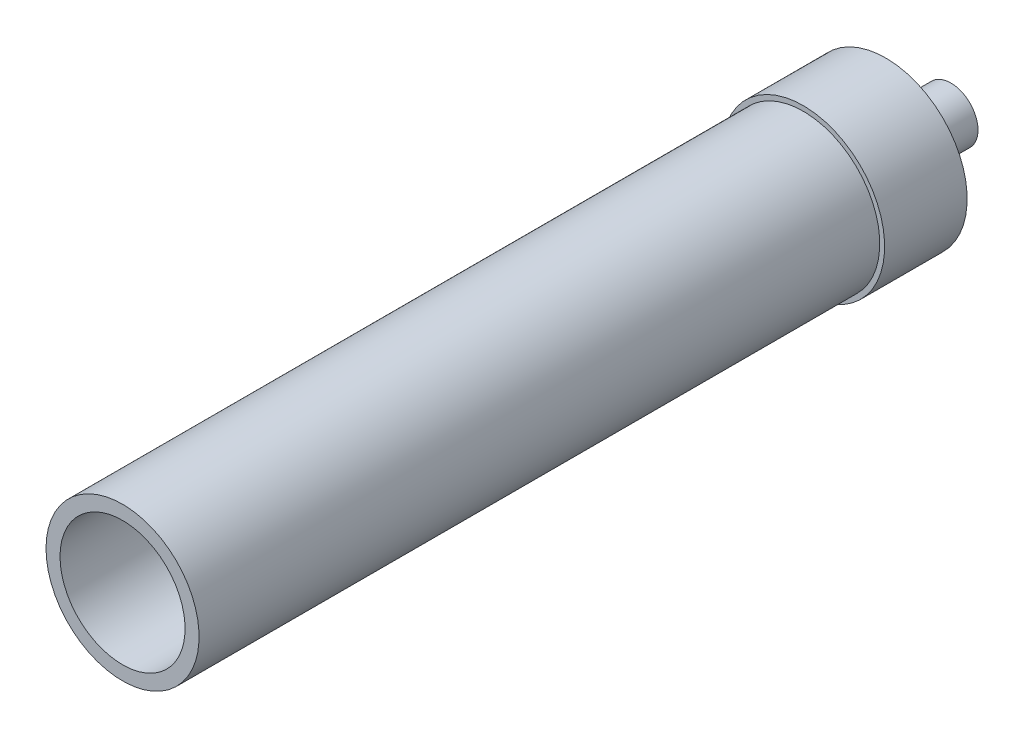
ISO-10303-21;
HEADER;
FILE_DESCRIPTION(('STEP AP214'),'2;1');
FILE_NAME('part.step','',(''),(''),'','','');
FILE_SCHEMA(('AUTOMOTIVE_DESIGN { 1 0 10303 214 1 1 1 1 }'));
ENDSEC;
DATA;
#1=APPLICATION_CONTEXT('core data for automotive mechanical design processes');
#2=APPLICATION_PROTOCOL_DEFINITION('international standard','automotive_design',2000,#1);
#3=PRODUCT_CONTEXT('',#1,'mechanical');
#4=PRODUCT('Part','Part','',(#3));
#5=PRODUCT_RELATED_PRODUCT_CATEGORY('part','',(#4));
#6=PRODUCT_DEFINITION_FORMATION('','',#4);
#7=PRODUCT_DEFINITION_CONTEXT('part definition',#1,'design');
#8=PRODUCT_DEFINITION('design','',#6,#7);
#9=PRODUCT_DEFINITION_SHAPE('','',#8);
#10=(LENGTH_UNIT() NAMED_UNIT(*) SI_UNIT(.MILLI.,.METRE.));
#11=(NAMED_UNIT(*) PLANE_ANGLE_UNIT() SI_UNIT($,.RADIAN.));
#12=(NAMED_UNIT(*) SI_UNIT($,.STERADIAN.) SOLID_ANGLE_UNIT());
#13=UNCERTAINTY_MEASURE_WITH_UNIT(LENGTH_MEASURE(1.E-05),#10,'distance_accuracy_value','');
#14=(GEOMETRIC_REPRESENTATION_CONTEXT(3) GLOBAL_UNCERTAINTY_ASSIGNED_CONTEXT((#13)) GLOBAL_UNIT_ASSIGNED_CONTEXT((#10,
#11,#12)) REPRESENTATION_CONTEXT('',''));
#15=CARTESIAN_POINT('',(0.,0.,0.));
#16=DIRECTION('',(0.,0.,1.));
#17=DIRECTION('',(1.,0.,0.));
#18=AXIS2_PLACEMENT_3D('',#15,#16,#17);
#19=CARTESIAN_POINT('',(0.,0.,0.));
#20=DIRECTION('',(0.,0.,1.));
#21=DIRECTION('',(1.,0.,0.));
#22=AXIS2_PLACEMENT_3D('',#19,#20,#21);
#23=PLANE('',#22);
#24=CARTESIAN_POINT('',(0.,0.,0.));
#25=DIRECTION('',(0.,0.,1.));
#26=DIRECTION('',(1.,0.,0.));
#27=AXIS2_PLACEMENT_3D('',#24,#25,#26);
#28=CIRCLE('',#27,9.525);
#29=CARTESIAN_POINT('',(-9.525,0.,0.));
#30=VERTEX_POINT('',#29);
#31=EDGE_CURVE('E56',#30,#30,#28,.T.);
#32=ORIENTED_EDGE('',*,*,#31,.F.);
#33=EDGE_LOOP('',(#32));
#34=FACE_BOUND('',#33,.T.);
#35=CARTESIAN_POINT('',(0.,0.,0.));
#36=DIRECTION('',(0.,0.,1.));
#37=DIRECTION('',(1.,0.,0.));
#38=AXIS2_PLACEMENT_3D('',#35,#36,#37);
#39=CIRCLE('',#38,4.445);
#40=CARTESIAN_POINT('',(4.445,0.,0.));
#41=VERTEX_POINT('',#40);
#42=EDGE_CURVE('E10',#41,#41,#39,.F.);
#43=ORIENTED_EDGE('',*,*,#42,.F.);
#44=EDGE_LOOP('',(#43));
#45=FACE_BOUND('',#44,.T.);
#46=ADVANCED_FACE('F30',(#34,#45),#23,.F.);
#47=CARTESIAN_POINT('',(0.,0.,89.281));
#48=DIRECTION('',(0.,0.,1.));
#49=DIRECTION('',(1.,0.,0.));
#50=AXIS2_PLACEMENT_3D('',#47,#48,#49);
#51=PLANE('',#50);
#52=CARTESIAN_POINT('',(0.,0.,89.281));
#53=DIRECTION('',(0.,0.,1.));
#54=DIRECTION('',(1.,0.,0.));
#55=AXIS2_PLACEMENT_3D('',#52,#53,#54);
#56=CIRCLE('',#55,8.9535);
#57=CARTESIAN_POINT('',(-8.95350000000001,0.,89.281));
#58=VERTEX_POINT('',#57);
#59=EDGE_CURVE('E41',#58,#58,#56,.T.);
#60=ORIENTED_EDGE('',*,*,#59,.T.);
#61=EDGE_LOOP('',(#60));
#62=FACE_BOUND('',#61,.T.);
#63=CARTESIAN_POINT('',(0.,0.,89.281));
#64=DIRECTION('',(0.,0.,1.));
#65=DIRECTION('',(1.,0.,0.));
#66=AXIS2_PLACEMENT_3D('',#63,#64,#65);
#67=CIRCLE('',#66,7.3152);
#68=CARTESIAN_POINT('',(-7.31520000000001,0.,89.281));
#69=VERTEX_POINT('',#68);
#70=EDGE_CURVE('E46',#69,#69,#67,.T.);
#71=ORIENTED_EDGE('',*,*,#70,.F.);
#72=EDGE_LOOP('',(#71));
#73=FACE_BOUND('',#72,.T.);
#74=ADVANCED_FACE('F75',(#62,#73),#51,.T.);
#75=CARTESIAN_POINT('',(0.,0.,89.281));
#76=DIRECTION('',(0.,0.,-1.));
#77=DIRECTION('',(-1.,0.,0.));
#78=AXIS2_PLACEMENT_3D('',#75,#76,#77);
#79=CYLINDRICAL_SURFACE('',#78,8.9535);
#80=CARTESIAN_POINT('',(0.,0.,9.65199999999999));
#81=DIRECTION('',(0.,0.,1.));
#82=DIRECTION('',(1.,0.,0.));
#83=AXIS2_PLACEMENT_3D('',#80,#81,#82);
#84=CIRCLE('',#83,8.9535);
#85=CARTESIAN_POINT('',(-8.9535,0.,9.65199999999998));
#86=VERTEX_POINT('',#85);
#87=EDGE_CURVE('E68',#86,#86,#84,.T.);
#88=CARTESIAN_POINT('',(-8.9535,0.,9.65199999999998));
#89=CARTESIAN_POINT('',(-8.9535,0.,10.48146875));
#90=CARTESIAN_POINT('',(-8.9535,0.,11.3109375));
#91=CARTESIAN_POINT('',(-8.9535,0.,12.969875));
#92=CARTESIAN_POINT('',(-8.9535,0.,13.79934375));
#93=CARTESIAN_POINT('',(-8.9535,0.,15.45828125));
#94=CARTESIAN_POINT('',(-8.9535,0.,16.28775));
#95=CARTESIAN_POINT('',(-8.9535,0.,17.9466875));
#96=CARTESIAN_POINT('',(-8.9535,0.,18.77615625));
#97=CARTESIAN_POINT('',(-8.9535,0.,20.43509375));
#98=CARTESIAN_POINT('',(-8.9535,0.,21.2645625));
#99=CARTESIAN_POINT('',(-8.9535,0.,22.9235));
#100=CARTESIAN_POINT('',(-8.9535,0.,23.75296875));
#101=CARTESIAN_POINT('',(-8.9535,0.,25.41190625));
#102=CARTESIAN_POINT('',(-8.9535,0.,26.241375));
#103=CARTESIAN_POINT('',(-8.9535,0.,27.9003125));
#104=CARTESIAN_POINT('',(-8.9535,0.,28.72978125));
#105=CARTESIAN_POINT('',(-8.9535,0.,30.38871875));
#106=CARTESIAN_POINT('',(-8.9535,0.,31.2181875));
#107=CARTESIAN_POINT('',(-8.9535,0.,32.877125));
#108=CARTESIAN_POINT('',(-8.9535,0.,33.70659375));
#109=CARTESIAN_POINT('',(-8.9535,0.,35.36553125));
#110=CARTESIAN_POINT('',(-8.9535,0.,36.195));
#111=CARTESIAN_POINT('',(-8.9535,0.,37.8539375));
#112=CARTESIAN_POINT('',(-8.95350000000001,0.,38.68340625));
#113=CARTESIAN_POINT('',(-8.95350000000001,0.,40.34234375));
#114=CARTESIAN_POINT('',(-8.95350000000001,0.,41.1718125));
#115=CARTESIAN_POINT('',(-8.95350000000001,0.,42.83075));
#116=CARTESIAN_POINT('',(-8.95350000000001,0.,43.66021875));
#117=CARTESIAN_POINT('',(-8.95350000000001,0.,45.31915625));
#118=CARTESIAN_POINT('',(-8.95350000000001,0.,46.148625));
#119=CARTESIAN_POINT('',(-8.95350000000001,0.,47.8075625));
#120=CARTESIAN_POINT('',(-8.95350000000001,0.,48.63703125));
#121=CARTESIAN_POINT('',(-8.95350000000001,0.,50.29596875));
#122=CARTESIAN_POINT('',(-8.95350000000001,0.,51.1254375));
#123=CARTESIAN_POINT('',(-8.95350000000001,0.,52.784375));
#124=CARTESIAN_POINT('',(-8.95350000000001,0.,53.61384375));
#125=CARTESIAN_POINT('',(-8.95350000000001,0.,55.27278125));
#126=CARTESIAN_POINT('',(-8.95350000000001,0.,56.10225));
#127=CARTESIAN_POINT('',(-8.95350000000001,0.,57.7611875));
#128=CARTESIAN_POINT('',(-8.95350000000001,0.,58.59065625));
#129=CARTESIAN_POINT('',(-8.95350000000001,0.,60.24959375));
#130=CARTESIAN_POINT('',(-8.95350000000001,0.,61.0790625));
#131=CARTESIAN_POINT('',(-8.95350000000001,0.,62.738));
#132=CARTESIAN_POINT('',(-8.95350000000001,0.,63.56746875));
#133=CARTESIAN_POINT('',(-8.95350000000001,0.,65.22640625));
#134=CARTESIAN_POINT('',(-8.95350000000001,0.,66.055875));
#135=CARTESIAN_POINT('',(-8.95350000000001,0.,67.7148125));
#136=CARTESIAN_POINT('',(-8.95350000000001,0.,68.54428125));
#137=CARTESIAN_POINT('',(-8.95350000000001,0.,70.20321875));
#138=CARTESIAN_POINT('',(-8.95350000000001,0.,71.0326875));
#139=CARTESIAN_POINT('',(-8.95350000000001,0.,72.691625));
#140=CARTESIAN_POINT('',(-8.95350000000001,0.,73.52109375));
#141=CARTESIAN_POINT('',(-8.95350000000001,0.,75.18003125));
#142=CARTESIAN_POINT('',(-8.95350000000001,0.,76.0094999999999));
#143=CARTESIAN_POINT('',(-8.95350000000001,0.,77.6684375));
#144=CARTESIAN_POINT('',(-8.95350000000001,0.,78.49790625));
#145=CARTESIAN_POINT('',(-8.95350000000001,0.,80.15684375));
#146=CARTESIAN_POINT('',(-8.95350000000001,0.,80.9863125));
#147=CARTESIAN_POINT('',(-8.95350000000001,0.,82.64525));
#148=CARTESIAN_POINT('',(-8.95350000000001,0.,83.47471875));
#149=CARTESIAN_POINT('',(-8.95350000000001,0.,85.13365625));
#150=CARTESIAN_POINT('',(-8.95350000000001,0.,85.963125));
#151=CARTESIAN_POINT('',(-8.95350000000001,0.,87.6220625));
#152=CARTESIAN_POINT('',(-8.95350000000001,0.,88.4515312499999));
#153=CARTESIAN_POINT('',(-8.95350000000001,0.,89.281));
#154=B_SPLINE_CURVE_WITH_KNOTS('',3,(#88,#89,#90,#91,#92,#93,#94,#95,#96,#97,#98,#99,#100,#101,
#102,#103,#104,#105,#106,#107,#108,#109,#110,#111,#112,#113,#114,#115,#116,#117,#118,#119,#120,
#121,#122,#123,#124,#125,#126,#127,#128,#129,#130,#131,#132,#133,#134,#135,#136,#137,#138,#139,
#140,#141,#142,#143,#144,#145,#146,#147,#148,#149,#150,#151,#152,#153),.UNSPECIFIED.,.F.,.F.,(4,
2,2,2,2,2,2,2,2,2,2,2,2,2,2,2,2,2,2,2,2,2,2,2,2,2,2,2,2,2,2,2,4),(0.,2.48840625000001,4.9768125,
7.46521875,9.95362499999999,12.44203125,14.9304375,17.41884375,19.90725,22.39565625,24.8840625,
27.37246875,29.860875,32.34928125,34.8376875,37.32609375,39.8145,42.30290625,44.7913125,
47.27971875,49.768125,52.25653125,54.7449375,57.23334375,59.72175,62.21015625,64.6985625,
67.18696875,69.675375,72.16378125,74.6521875,77.14059375,79.629),.UNSPECIFIED.);
#155=EDGE_CURVE('BSEAM32',#86,#58,#154,.T.);
#156=ORIENTED_EDGE('',*,*,#87,.T.);
#157=ORIENTED_EDGE('',*,*,#59,.F.);
#158=ORIENTED_EDGE('',*,*,#155,.T.);
#159=ORIENTED_EDGE('',*,*,#155,.F.);
#160=EDGE_LOOP('',(#156,#158,#157,#159));
#161=FACE_BOUND('',#160,.T.);
#162=ADVANCED_FACE('F32',(#161),#79,.T.);
#163=CARTESIAN_POINT('',(0.,0.,89.281));
#164=DIRECTION('',(0.,0.,-1.));
#165=DIRECTION('',(-1.,0.,0.));
#166=AXIS2_PLACEMENT_3D('',#163,#164,#165);
#167=CYLINDRICAL_SURFACE('',#166,7.3152);
#168=CARTESIAN_POINT('',(0.,0.,9.65199999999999));
#169=DIRECTION('',(0.,0.,1.));
#170=DIRECTION('',(1.,0.,0.));
#171=AXIS2_PLACEMENT_3D('',#168,#169,#170);
#172=CIRCLE('',#171,7.3152);
#173=CARTESIAN_POINT('',(-7.3152,0.,9.65199999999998));
#174=VERTEX_POINT('',#173);
#175=EDGE_CURVE('E37',#174,#174,#172,.T.);
#176=CARTESIAN_POINT('',(-7.3152,0.,9.65199999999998));
#177=CARTESIAN_POINT('',(-7.3152,0.,10.48146875));
#178=CARTESIAN_POINT('',(-7.3152,0.,11.3109375));
#179=CARTESIAN_POINT('',(-7.3152,0.,12.969875));
#180=CARTESIAN_POINT('',(-7.3152,0.,13.79934375));
#181=CARTESIAN_POINT('',(-7.3152,0.,15.45828125));
#182=CARTESIAN_POINT('',(-7.3152,0.,16.28775));
#183=CARTESIAN_POINT('',(-7.3152,0.,17.9466875));
#184=CARTESIAN_POINT('',(-7.3152,0.,18.77615625));
#185=CARTESIAN_POINT('',(-7.3152,0.,20.43509375));
#186=CARTESIAN_POINT('',(-7.3152,0.,21.2645625));
#187=CARTESIAN_POINT('',(-7.3152,0.,22.9235));
#188=CARTESIAN_POINT('',(-7.3152,0.,23.75296875));
#189=CARTESIAN_POINT('',(-7.3152,0.,25.41190625));
#190=CARTESIAN_POINT('',(-7.3152,0.,26.241375));
#191=CARTESIAN_POINT('',(-7.3152,0.,27.9003125));
#192=CARTESIAN_POINT('',(-7.3152,0.,28.72978125));
#193=CARTESIAN_POINT('',(-7.3152,0.,30.38871875));
#194=CARTESIAN_POINT('',(-7.3152,0.,31.2181875));
#195=CARTESIAN_POINT('',(-7.3152,0.,32.877125));
#196=CARTESIAN_POINT('',(-7.3152,0.,33.70659375));
#197=CARTESIAN_POINT('',(-7.3152,0.,35.36553125));
#198=CARTESIAN_POINT('',(-7.3152,0.,36.195));
#199=CARTESIAN_POINT('',(-7.3152,0.,37.8539375));
#200=CARTESIAN_POINT('',(-7.3152,0.,38.68340625));
#201=CARTESIAN_POINT('',(-7.3152,0.,40.34234375));
#202=CARTESIAN_POINT('',(-7.31520000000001,0.,41.1718125));
#203=CARTESIAN_POINT('',(-7.31520000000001,0.,42.83075));
#204=CARTESIAN_POINT('',(-7.31520000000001,0.,43.66021875));
#205=CARTESIAN_POINT('',(-7.31520000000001,0.,45.31915625));
#206=CARTESIAN_POINT('',(-7.31520000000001,0.,46.148625));
#207=CARTESIAN_POINT('',(-7.31520000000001,0.,47.8075625));
#208=CARTESIAN_POINT('',(-7.31520000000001,0.,48.63703125));
#209=CARTESIAN_POINT('',(-7.31520000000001,0.,50.29596875));
#210=CARTESIAN_POINT('',(-7.31520000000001,0.,51.1254375));
#211=CARTESIAN_POINT('',(-7.31520000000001,0.,52.784375));
#212=CARTESIAN_POINT('',(-7.31520000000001,0.,53.61384375));
#213=CARTESIAN_POINT('',(-7.31520000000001,0.,55.27278125));
#214=CARTESIAN_POINT('',(-7.31520000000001,0.,56.10225));
#215=CARTESIAN_POINT('',(-7.31520000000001,0.,57.7611875));
#216=CARTESIAN_POINT('',(-7.31520000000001,0.,58.59065625));
#217=CARTESIAN_POINT('',(-7.31520000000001,0.,60.24959375));
#218=CARTESIAN_POINT('',(-7.31520000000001,0.,61.0790625));
#219=CARTESIAN_POINT('',(-7.31520000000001,0.,62.738));
#220=CARTESIAN_POINT('',(-7.31520000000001,0.,63.56746875));
#221=CARTESIAN_POINT('',(-7.31520000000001,0.,65.22640625));
#222=CARTESIAN_POINT('',(-7.31520000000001,0.,66.055875));
#223=CARTESIAN_POINT('',(-7.31520000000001,0.,67.7148125));
#224=CARTESIAN_POINT('',(-7.31520000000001,0.,68.54428125));
#225=CARTESIAN_POINT('',(-7.31520000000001,0.,70.20321875));
#226=CARTESIAN_POINT('',(-7.31520000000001,0.,71.0326875));
#227=CARTESIAN_POINT('',(-7.31520000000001,0.,72.691625));
#228=CARTESIAN_POINT('',(-7.31520000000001,0.,73.52109375));
#229=CARTESIAN_POINT('',(-7.31520000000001,0.,75.18003125));
#230=CARTESIAN_POINT('',(-7.31520000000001,0.,76.0095));
#231=CARTESIAN_POINT('',(-7.31520000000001,0.,77.6684375));
#232=CARTESIAN_POINT('',(-7.31520000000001,0.,78.49790625));
#233=CARTESIAN_POINT('',(-7.31520000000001,0.,80.15684375));
#234=CARTESIAN_POINT('',(-7.31520000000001,0.,80.9863125));
#235=CARTESIAN_POINT('',(-7.31520000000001,0.,82.64525));
#236=CARTESIAN_POINT('',(-7.31520000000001,0.,83.47471875));
#237=CARTESIAN_POINT('',(-7.31520000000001,0.,85.13365625));
#238=CARTESIAN_POINT('',(-7.31520000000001,0.,85.963125));
#239=CARTESIAN_POINT('',(-7.31520000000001,0.,87.6220625));
#240=CARTESIAN_POINT('',(-7.31520000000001,0.,88.45153125));
#241=CARTESIAN_POINT('',(-7.31520000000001,0.,89.281));
#242=B_SPLINE_CURVE_WITH_KNOTS('',3,(#176,#177,#178,#179,#180,#181,#182,#183,#184,#185,#186,
#187,#188,#189,#190,#191,#192,#193,#194,#195,#196,#197,#198,#199,#200,#201,#202,#203,#204,#205,
#206,#207,#208,#209,#210,#211,#212,#213,#214,#215,#216,#217,#218,#219,#220,#221,#222,#223,#224,
#225,#226,#227,#228,#229,#230,#231,#232,#233,#234,#235,#236,#237,#238,#239,#240,#241),
.UNSPECIFIED.,.F.,.F.,(4,2,2,2,2,2,2,2,2,2,2,2,2,2,2,2,2,2,2,2,2,2,2,2,2,2,2,2,2,2,2,2,4),(0.,
2.48840625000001,4.9768125,7.46521875,9.95362499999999,12.44203125,14.9304375,17.41884375,
19.90725,22.39565625,24.8840625,27.37246875,29.860875,32.34928125,34.8376875,37.32609375,
39.8145,42.30290625,44.7913125,47.27971875,49.768125,52.25653125,54.7449375,57.23334375,
59.72175,62.21015625,64.6985625,67.18696875,69.675375,72.16378125,74.6521875,77.14059375,
79.629),.UNSPECIFIED.);
#243=EDGE_CURVE('BSEAM73',#174,#69,#242,.T.);
#244=ORIENTED_EDGE('',*,*,#175,.F.);
#245=ORIENTED_EDGE('',*,*,#70,.T.);
#246=ORIENTED_EDGE('',*,*,#243,.T.);
#247=ORIENTED_EDGE('',*,*,#243,.F.);
#248=EDGE_LOOP('',(#244,#246,#245,#247));
#249=FACE_BOUND('',#248,.T.);
#250=ADVANCED_FACE('F73',(#249),#167,.F.);
#251=CARTESIAN_POINT('',(0.,0.,9.65199999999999));
#252=DIRECTION('',(0.,0.,1.));
#253=DIRECTION('',(1.,0.,0.));
#254=AXIS2_PLACEMENT_3D('',#251,#252,#253);
#255=PLANE('',#254);
#256=ORIENTED_EDGE('',*,*,#175,.T.);
#257=EDGE_LOOP('',(#256));
#258=FACE_BOUND('',#257,.T.);
#259=ADVANCED_FACE('F88',(#258),#255,.T.);
#260=CARTESIAN_POINT('',(0.,0.,9.65199999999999));
#261=DIRECTION('',(0.,0.,1.));
#262=DIRECTION('',(1.,0.,0.));
#263=AXIS2_PLACEMENT_3D('',#260,#261,#262);
#264=CIRCLE('',#263,9.525);
#265=CARTESIAN_POINT('',(-9.525,0.,9.65199999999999));
#266=VERTEX_POINT('',#265);
#267=EDGE_CURVE('E65',#266,#266,#264,.T.);
#268=ORIENTED_EDGE('',*,*,#267,.T.);
#269=EDGE_LOOP('',(#268));
#270=FACE_BOUND('',#269,.T.);
#271=ORIENTED_EDGE('',*,*,#87,.F.);
#272=EDGE_LOOP('',(#271));
#273=FACE_BOUND('',#272,.T.);
#274=ADVANCED_FACE('F94',(#270,#273),#255,.T.);
#275=CARTESIAN_POINT('',(0.,0.,9.65199999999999));
#276=DIRECTION('',(0.,0.,-1.));
#277=DIRECTION('',(-1.,0.,0.));
#278=AXIS2_PLACEMENT_3D('',#275,#276,#277);
#279=CYLINDRICAL_SURFACE('',#278,9.525);
#280=CARTESIAN_POINT('',(-9.525,0.,9.65199999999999));
#281=CARTESIAN_POINT('',(-9.525,0.,9.55145833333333));
#282=CARTESIAN_POINT('',(-9.525,0.,9.45091666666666));
#283=CARTESIAN_POINT('',(-9.525,0.,9.24983333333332));
#284=CARTESIAN_POINT('',(-9.525,0.,9.14929166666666));
#285=CARTESIAN_POINT('',(-9.525,0.,8.94820833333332));
#286=CARTESIAN_POINT('',(-9.525,0.,8.84766666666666));
#287=CARTESIAN_POINT('',(-9.525,0.,8.64658333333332));
#288=CARTESIAN_POINT('',(-9.525,0.,8.54604166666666));
#289=CARTESIAN_POINT('',(-9.525,0.,8.34495833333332));
#290=CARTESIAN_POINT('',(-9.525,0.,8.24441666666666));
#291=CARTESIAN_POINT('',(-9.525,0.,8.04333333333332));
#292=CARTESIAN_POINT('',(-9.525,0.,7.94279166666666));
#293=CARTESIAN_POINT('',(-9.525,0.,7.74170833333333));
#294=CARTESIAN_POINT('',(-9.525,0.,7.64116666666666));
#295=CARTESIAN_POINT('',(-9.525,0.,7.44008333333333));
#296=CARTESIAN_POINT('',(-9.525,0.,7.33954166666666));
#297=CARTESIAN_POINT('',(-9.525,0.,7.13845833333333));
#298=CARTESIAN_POINT('',(-9.525,0.,7.03791666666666));
#299=CARTESIAN_POINT('',(-9.525,0.,6.83683333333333));
#300=CARTESIAN_POINT('',(-9.525,0.,6.73629166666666));
#301=CARTESIAN_POINT('',(-9.525,0.,6.53520833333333));
#302=CARTESIAN_POINT('',(-9.525,0.,6.43466666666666));
#303=CARTESIAN_POINT('',(-9.525,0.,6.23358333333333));
#304=CARTESIAN_POINT('',(-9.525,0.,6.13304166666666));
#305=CARTESIAN_POINT('',(-9.525,0.,5.93195833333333));
#306=CARTESIAN_POINT('',(-9.525,0.,5.83141666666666));
#307=CARTESIAN_POINT('',(-9.525,0.,5.63033333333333));
#308=CARTESIAN_POINT('',(-9.525,0.,5.52979166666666));
#309=CARTESIAN_POINT('',(-9.525,0.,5.32870833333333));
#310=CARTESIAN_POINT('',(-9.525,0.,5.22816666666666));
#311=CARTESIAN_POINT('',(-9.525,0.,5.02708333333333));
#312=CARTESIAN_POINT('',(-9.525,0.,4.92654166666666));
#313=CARTESIAN_POINT('',(-9.525,0.,4.72545833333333));
#314=CARTESIAN_POINT('',(-9.525,0.,4.62491666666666));
#315=CARTESIAN_POINT('',(-9.525,0.,4.42383333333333));
#316=CARTESIAN_POINT('',(-9.525,0.,4.32329166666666));
#317=CARTESIAN_POINT('',(-9.525,0.,4.12220833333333));
#318=CARTESIAN_POINT('',(-9.525,0.,4.02166666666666));
#319=CARTESIAN_POINT('',(-9.525,0.,3.82058333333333));
#320=CARTESIAN_POINT('',(-9.525,0.,3.72004166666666));
#321=CARTESIAN_POINT('',(-9.525,0.,3.51895833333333));
#322=CARTESIAN_POINT('',(-9.525,0.,3.41841666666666));
#323=CARTESIAN_POINT('',(-9.525,0.,3.21733333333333));
#324=CARTESIAN_POINT('',(-9.525,0.,3.11679166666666));
#325=CARTESIAN_POINT('',(-9.525,0.,2.91570833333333));
#326=CARTESIAN_POINT('',(-9.525,0.,2.81516666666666));
#327=CARTESIAN_POINT('',(-9.525,0.,2.61408333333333));
#328=CARTESIAN_POINT('',(-9.525,0.,2.51354166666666));
#329=CARTESIAN_POINT('',(-9.525,0.,2.31245833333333));
#330=CARTESIAN_POINT('',(-9.525,0.,2.21191666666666));
#331=CARTESIAN_POINT('',(-9.525,0.,2.01083333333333));
#332=CARTESIAN_POINT('',(-9.525,0.,1.91029166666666));
#333=CARTESIAN_POINT('',(-9.525,0.,1.70920833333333));
#334=CARTESIAN_POINT('',(-9.525,0.,1.60866666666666));
#335=CARTESIAN_POINT('',(-9.525,0.,1.40758333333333));
#336=CARTESIAN_POINT('',(-9.525,0.,1.30704166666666));
#337=CARTESIAN_POINT('',(-9.525,0.,1.10595833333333));
#338=CARTESIAN_POINT('',(-9.525,0.,1.00541666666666));
#339=CARTESIAN_POINT('',(-9.525,0.,0.804333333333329));
#340=CARTESIAN_POINT('',(-9.525,0.,0.703791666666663));
#341=CARTESIAN_POINT('',(-9.525,0.,0.50270833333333));
#342=CARTESIAN_POINT('',(-9.525,0.,0.402166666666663));
#343=CARTESIAN_POINT('',(-9.525,0.,0.20108333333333));
#344=CARTESIAN_POINT('',(-9.525,0.,0.100541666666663));
#345=CARTESIAN_POINT('',(-9.525,0.,0.));
#346=B_SPLINE_CURVE_WITH_KNOTS('',3,(#280,#281,#282,#283,#284,#285,#286,#287,#288,#289,#290,
#291,#292,#293,#294,#295,#296,#297,#298,#299,#300,#301,#302,#303,#304,#305,#306,#307,#308,#309,
#310,#311,#312,#313,#314,#315,#316,#317,#318,#319,#320,#321,#322,#323,#324,#325,#326,#327,#328,
#329,#330,#331,#332,#333,#334,#335,#336,#337,#338,#339,#340,#341,#342,#343,#344,#345),
.UNSPECIFIED.,.F.,.F.,(4,2,2,2,2,2,2,2,2,2,2,2,2,2,2,2,2,2,2,2,2,2,2,2,2,2,2,2,2,2,2,2,4),(0.,
0.301625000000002,0.603250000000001,0.904875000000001,1.2065,1.508125,1.80975,2.111375,2.413,
2.714625,3.01625,3.317875,3.6195,3.921125,4.22275,4.524375,4.826,5.127625,5.42925,5.730875,
6.0325,6.334125,6.63575,6.937375,7.239,7.540625,7.84225,8.143875,8.4455,8.747125,9.04875,
9.350375,9.652),.UNSPECIFIED.);
#347=EDGE_CURVE('BSEAM90',#266,#30,#346,.T.);
#348=ORIENTED_EDGE('',*,*,#267,.F.);
#349=ORIENTED_EDGE('',*,*,#31,.T.);
#350=ORIENTED_EDGE('',*,*,#347,.T.);
#351=ORIENTED_EDGE('',*,*,#347,.F.);
#352=EDGE_LOOP('',(#348,#350,#349,#351));
#353=FACE_BOUND('',#352,.T.);
#354=ADVANCED_FACE('F90',(#353),#279,.T.);
#355=CARTESIAN_POINT('',(0.,0.,-1.27));
#356=DIRECTION('',(0.,0.,-1.));
#357=DIRECTION('',(-1.,0.,0.));
#358=AXIS2_PLACEMENT_3D('',#355,#356,#357);
#359=PLANE('',#358);
#360=CARTESIAN_POINT('',(0.,0.,-1.27));
#361=DIRECTION('',(0.,0.,-1.));
#362=DIRECTION('',(-1.,0.,0.));
#363=AXIS2_PLACEMENT_3D('',#360,#361,#362);
#364=CIRCLE('',#363,4.445);
#365=CARTESIAN_POINT('',(4.445,0.,-1.27));
#366=VERTEX_POINT('',#365);
#367=EDGE_CURVE('E52',#366,#366,#364,.T.);
#368=ORIENTED_EDGE('',*,*,#367,.T.);
#369=EDGE_LOOP('',(#368));
#370=FACE_BOUND('',#369,.T.);
#371=CARTESIAN_POINT('',(0.,0.,-1.27));
#372=DIRECTION('',(0.,0.,-1.));
#373=DIRECTION('',(-1.,0.,0.));
#374=AXIS2_PLACEMENT_3D('',#371,#372,#373);
#375=CIRCLE('',#374,3.175);
#376=CARTESIAN_POINT('',(3.175,0.,-1.27));
#377=VERTEX_POINT('',#376);
#378=EDGE_CURVE('E49',#377,#377,#375,.T.);
#379=ORIENTED_EDGE('',*,*,#378,.F.);
#380=EDGE_LOOP('',(#379));
#381=FACE_BOUND('',#380,.T.);
#382=ADVANCED_FACE('F93',(#370,#381),#359,.T.);
#383=CARTESIAN_POINT('',(0.,0.,-1.27));
#384=DIRECTION('',(0.,0.,1.));
#385=DIRECTION('',(1.,0.,0.));
#386=AXIS2_PLACEMENT_3D('',#383,#384,#385);
#387=CYLINDRICAL_SURFACE('',#386,4.445);
#388=CARTESIAN_POINT('',(4.445,0.,-1.27));
#389=CARTESIAN_POINT('',(4.445,0.,-1.25677083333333));
#390=CARTESIAN_POINT('',(4.445,0.,-1.24354166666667));
#391=CARTESIAN_POINT('',(4.445,0.,-1.21708333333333));
#392=CARTESIAN_POINT('',(4.445,0.,-1.20385416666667));
#393=CARTESIAN_POINT('',(4.445,0.,-1.17739583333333));
#394=CARTESIAN_POINT('',(4.445,0.,-1.16416666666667));
#395=CARTESIAN_POINT('',(4.445,0.,-1.13770833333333));
#396=CARTESIAN_POINT('',(4.445,0.,-1.12447916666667));
#397=CARTESIAN_POINT('',(4.445,0.,-1.09802083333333));
#398=CARTESIAN_POINT('',(4.445,0.,-1.08479166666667));
#399=CARTESIAN_POINT('',(4.445,0.,-1.05833333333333));
#400=CARTESIAN_POINT('',(4.445,0.,-1.04510416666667));
#401=CARTESIAN_POINT('',(4.445,0.,-1.01864583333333));
#402=CARTESIAN_POINT('',(4.445,0.,-1.00541666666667));
#403=CARTESIAN_POINT('',(4.445,0.,-0.978958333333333));
#404=CARTESIAN_POINT('',(4.445,0.,-0.965729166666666));
#405=CARTESIAN_POINT('',(4.445,0.,-0.939270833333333));
#406=CARTESIAN_POINT('',(4.445,0.,-0.926041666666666));
#407=CARTESIAN_POINT('',(4.445,0.,-0.899583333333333));
#408=CARTESIAN_POINT('',(4.445,0.,-0.886354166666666));
#409=CARTESIAN_POINT('',(4.445,0.,-0.859895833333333));
#410=CARTESIAN_POINT('',(4.445,0.,-0.846666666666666));
#411=CARTESIAN_POINT('',(4.445,0.,-0.820208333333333));
#412=CARTESIAN_POINT('',(4.445,0.,-0.806979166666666));
#413=CARTESIAN_POINT('',(4.445,0.,-0.780520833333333));
#414=CARTESIAN_POINT('',(4.445,0.,-0.767291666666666));
#415=CARTESIAN_POINT('',(4.445,0.,-0.740833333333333));
#416=CARTESIAN_POINT('',(4.445,0.,-0.727604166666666));
#417=CARTESIAN_POINT('',(4.445,0.,-0.701145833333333));
#418=CARTESIAN_POINT('',(4.445,0.,-0.687916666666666));
#419=CARTESIAN_POINT('',(4.445,0.,-0.661458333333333));
#420=CARTESIAN_POINT('',(4.445,0.,-0.648229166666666));
#421=CARTESIAN_POINT('',(4.445,0.,-0.621770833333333));
#422=CARTESIAN_POINT('',(4.445,0.,-0.608541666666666));
#423=CARTESIAN_POINT('',(4.445,0.,-0.582083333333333));
#424=CARTESIAN_POINT('',(4.445,0.,-0.568854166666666));
#425=CARTESIAN_POINT('',(4.445,0.,-0.542395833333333));
#426=CARTESIAN_POINT('',(4.445,0.,-0.529166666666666));
#427=CARTESIAN_POINT('',(4.445,0.,-0.502708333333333));
#428=CARTESIAN_POINT('',(4.445,0.,-0.489479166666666));
#429=CARTESIAN_POINT('',(4.445,0.,-0.463020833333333));
#430=CARTESIAN_POINT('',(4.445,0.,-0.449791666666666));
#431=CARTESIAN_POINT('',(4.445,0.,-0.423333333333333));
#432=CARTESIAN_POINT('',(4.445,0.,-0.410104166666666));
#433=CARTESIAN_POINT('',(4.445,0.,-0.383645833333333));
#434=CARTESIAN_POINT('',(4.445,0.,-0.370416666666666));
#435=CARTESIAN_POINT('',(4.445,0.,-0.343958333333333));
#436=CARTESIAN_POINT('',(4.445,0.,-0.330729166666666));
#437=CARTESIAN_POINT('',(4.445,0.,-0.304270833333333));
#438=CARTESIAN_POINT('',(4.445,0.,-0.291041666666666));
#439=CARTESIAN_POINT('',(4.445,0.,-0.264583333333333));
#440=CARTESIAN_POINT('',(4.445,0.,-0.251354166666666));
#441=CARTESIAN_POINT('',(4.445,0.,-0.224895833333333));
#442=CARTESIAN_POINT('',(4.445,0.,-0.211666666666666));
#443=CARTESIAN_POINT('',(4.445,0.,-0.185208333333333));
#444=CARTESIAN_POINT('',(4.445,0.,-0.171979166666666));
#445=CARTESIAN_POINT('',(4.445,0.,-0.145520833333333));
#446=CARTESIAN_POINT('',(4.445,0.,-0.132291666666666));
#447=CARTESIAN_POINT('',(4.445,0.,-0.105833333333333));
#448=CARTESIAN_POINT('',(4.445,0.,-0.092604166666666));
#449=CARTESIAN_POINT('',(4.445,0.,-0.0661458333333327));
#450=CARTESIAN_POINT('',(4.445,0.,-0.052916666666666));
#451=CARTESIAN_POINT('',(4.445,0.,-0.0264583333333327));
#452=CARTESIAN_POINT('',(4.445,0.,-0.013229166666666));
#453=CARTESIAN_POINT('',(4.445,0.,0.));
#454=B_SPLINE_CURVE_WITH_KNOTS('',3,(#388,#389,#390,#391,#392,#393,#394,#395,#396,#397,#398,
#399,#400,#401,#402,#403,#404,#405,#406,#407,#408,#409,#410,#411,#412,#413,#414,#415,#416,#417,
#418,#419,#420,#421,#422,#423,#424,#425,#426,#427,#428,#429,#430,#431,#432,#433,#434,#435,#436,
#437,#438,#439,#440,#441,#442,#443,#444,#445,#446,#447,#448,#449,#450,#451,#452,#453),
.UNSPECIFIED.,.F.,.F.,(4,2,2,2,2,2,2,2,2,2,2,2,2,2,2,2,2,2,2,2,2,2,2,2,2,2,2,2,2,2,2,2,4),(0.,
0.0396874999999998,0.0793749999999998,0.1190625,0.15875,0.1984375,0.238125,0.2778125,0.3175,
0.3571875,0.396875,0.4365625,0.47625,0.5159375,0.555625,0.5953125,0.635,0.6746875,0.714375,
0.7540625,0.79375,0.8334375,0.873125,0.9128125,0.9525,0.9921875,1.031875,1.0715625,1.11125,
1.1509375,1.190625,1.2303125,1.27),.UNSPECIFIED.);
#455=EDGE_CURVE('BSEAM104',#366,#41,#454,.T.);
#456=ORIENTED_EDGE('',*,*,#367,.F.);
#457=ORIENTED_EDGE('',*,*,#42,.T.);
#458=ORIENTED_EDGE('',*,*,#455,.T.);
#459=ORIENTED_EDGE('',*,*,#455,.F.);
#460=EDGE_LOOP('',(#456,#458,#457,#459));
#461=FACE_BOUND('',#460,.T.);
#462=ADVANCED_FACE('F104',(#461),#387,.T.);
#463=CARTESIAN_POINT('',(0.,0.,-7.62));
#464=DIRECTION('',(0.,0.,-1.));
#465=DIRECTION('',(-1.,0.,0.));
#466=AXIS2_PLACEMENT_3D('',#463,#464,#465);
#467=PLANE('',#466);
#468=CARTESIAN_POINT('',(0.,0.,-7.62));
#469=DIRECTION('',(0.,0.,-1.));
#470=DIRECTION('',(-1.,0.,0.));
#471=AXIS2_PLACEMENT_3D('',#468,#469,#470);
#472=CIRCLE('',#471,3.175);
#473=CARTESIAN_POINT('',(3.175,0.,-7.62));
#474=VERTEX_POINT('',#473);
#475=EDGE_CURVE('E51',#474,#474,#472,.T.);
#476=ORIENTED_EDGE('',*,*,#475,.T.);
#477=EDGE_LOOP('',(#476));
#478=FACE_BOUND('',#477,.T.);
#479=ADVANCED_FACE('F101',(#478),#467,.T.);
#480=CARTESIAN_POINT('',(0.,0.,-7.62));
#481=DIRECTION('',(0.,0.,1.));
#482=DIRECTION('',(1.,0.,0.));
#483=AXIS2_PLACEMENT_3D('',#480,#481,#482);
#484=CYLINDRICAL_SURFACE('',#483,3.175);
#485=CARTESIAN_POINT('',(3.175,0.,-1.27));
#486=CARTESIAN_POINT('',(3.175,0.,-1.33614583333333));
#487=CARTESIAN_POINT('',(3.175,0.,-1.40229166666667));
#488=CARTESIAN_POINT('',(3.175,0.,-1.53458333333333));
#489=CARTESIAN_POINT('',(3.175,0.,-1.60072916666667));
#490=CARTESIAN_POINT('',(3.175,0.,-1.73302083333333));
#491=CARTESIAN_POINT('',(3.175,0.,-1.79916666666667));
#492=CARTESIAN_POINT('',(3.175,0.,-1.93145833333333));
#493=CARTESIAN_POINT('',(3.175,0.,-1.99760416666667));
#494=CARTESIAN_POINT('',(3.175,0.,-2.12989583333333));
#495=CARTESIAN_POINT('',(3.175,0.,-2.19604166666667));
#496=CARTESIAN_POINT('',(3.175,0.,-2.32833333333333));
#497=CARTESIAN_POINT('',(3.175,0.,-2.39447916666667));
#498=CARTESIAN_POINT('',(3.175,0.,-2.52677083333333));
#499=CARTESIAN_POINT('',(3.175,0.,-2.59291666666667));
#500=CARTESIAN_POINT('',(3.175,0.,-2.72520833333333));
#501=CARTESIAN_POINT('',(3.175,0.,-2.79135416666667));
#502=CARTESIAN_POINT('',(3.175,0.,-2.92364583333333));
#503=CARTESIAN_POINT('',(3.175,0.,-2.98979166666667));
#504=CARTESIAN_POINT('',(3.175,0.,-3.12208333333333));
#505=CARTESIAN_POINT('',(3.175,0.,-3.18822916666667));
#506=CARTESIAN_POINT('',(3.175,0.,-3.32052083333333));
#507=CARTESIAN_POINT('',(3.175,0.,-3.38666666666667));
#508=CARTESIAN_POINT('',(3.175,0.,-3.51895833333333));
#509=CARTESIAN_POINT('',(3.175,0.,-3.58510416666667));
#510=CARTESIAN_POINT('',(3.175,0.,-3.71739583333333));
#511=CARTESIAN_POINT('',(3.175,0.,-3.78354166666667));
#512=CARTESIAN_POINT('',(3.175,0.,-3.91583333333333));
#513=CARTESIAN_POINT('',(3.175,0.,-3.98197916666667));
#514=CARTESIAN_POINT('',(3.175,0.,-4.11427083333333));
#515=CARTESIAN_POINT('',(3.175,0.,-4.18041666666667));
#516=CARTESIAN_POINT('',(3.175,0.,-4.31270833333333));
#517=CARTESIAN_POINT('',(3.175,0.,-4.37885416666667));
#518=CARTESIAN_POINT('',(3.175,0.,-4.51114583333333));
#519=CARTESIAN_POINT('',(3.175,0.,-4.57729166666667));
#520=CARTESIAN_POINT('',(3.175,0.,-4.70958333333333));
#521=CARTESIAN_POINT('',(3.175,0.,-4.77572916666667));
#522=CARTESIAN_POINT('',(3.175,0.,-4.90802083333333));
#523=CARTESIAN_POINT('',(3.175,0.,-4.97416666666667));
#524=CARTESIAN_POINT('',(3.175,0.,-5.10645833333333));
#525=CARTESIAN_POINT('',(3.175,0.,-5.17260416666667));
#526=CARTESIAN_POINT('',(3.175,0.,-5.30489583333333));
#527=CARTESIAN_POINT('',(3.175,0.,-5.37104166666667));
#528=CARTESIAN_POINT('',(3.175,0.,-5.50333333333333));
#529=CARTESIAN_POINT('',(3.175,0.,-5.56947916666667));
#530=CARTESIAN_POINT('',(3.175,0.,-5.70177083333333));
#531=CARTESIAN_POINT('',(3.175,0.,-5.76791666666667));
#532=CARTESIAN_POINT('',(3.175,0.,-5.90020833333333));
#533=CARTESIAN_POINT('',(3.175,0.,-5.96635416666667));
#534=CARTESIAN_POINT('',(3.175,0.,-6.09864583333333));
#535=CARTESIAN_POINT('',(3.175,0.,-6.16479166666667));
#536=CARTESIAN_POINT('',(3.175,0.,-6.29708333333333));
#537=CARTESIAN_POINT('',(3.175,0.,-6.36322916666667));
#538=CARTESIAN_POINT('',(3.175,0.,-6.49552083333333));
#539=CARTESIAN_POINT('',(3.175,0.,-6.56166666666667));
#540=CARTESIAN_POINT('',(3.175,0.,-6.69395833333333));
#541=CARTESIAN_POINT('',(3.175,0.,-6.76010416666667));
#542=CARTESIAN_POINT('',(3.175,0.,-6.89239583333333));
#543=CARTESIAN_POINT('',(3.175,0.,-6.95854166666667));
#544=CARTESIAN_POINT('',(3.175,0.,-7.09083333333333));
#545=CARTESIAN_POINT('',(3.175,0.,-7.15697916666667));
#546=CARTESIAN_POINT('',(3.175,0.,-7.28927083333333));
#547=CARTESIAN_POINT('',(3.175,0.,-7.35541666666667));
#548=CARTESIAN_POINT('',(3.175,0.,-7.48770833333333));
#549=CARTESIAN_POINT('',(3.175,0.,-7.55385416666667));
#550=CARTESIAN_POINT('',(3.175,0.,-7.62));
#551=B_SPLINE_CURVE_WITH_KNOTS('',3,(#485,#486,#487,#488,#489,#490,#491,#492,#493,#494,#495,
#496,#497,#498,#499,#500,#501,#502,#503,#504,#505,#506,#507,#508,#509,#510,#511,#512,#513,#514,
#515,#516,#517,#518,#519,#520,#521,#522,#523,#524,#525,#526,#527,#528,#529,#530,#531,#532,#533,
#534,#535,#536,#537,#538,#539,#540,#541,#542,#543,#544,#545,#546,#547,#548,#549,#550),
.UNSPECIFIED.,.F.,.F.,(4,2,2,2,2,2,2,2,2,2,2,2,2,2,2,2,2,2,2,2,2,2,2,2,2,2,2,2,2,2,2,2,4),(0.,
0.1984375,0.396875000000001,0.5953125,0.79375,0.9921875,1.190625,1.3890625,1.5875,1.7859375,
1.984375,2.1828125,2.38125,2.5796875,2.778125,2.9765625,3.175,3.3734375,3.571875,3.7703125,
3.96875,4.1671875,4.365625,4.5640625,4.7625,4.9609375,5.159375,5.3578125,5.55625,5.7546875,
5.953125,6.1515625,6.35),.UNSPECIFIED.);
#552=EDGE_CURVE('BSEAM98',#377,#474,#551,.T.);
#553=ORIENTED_EDGE('',*,*,#378,.T.);
#554=ORIENTED_EDGE('',*,*,#475,.F.);
#555=ORIENTED_EDGE('',*,*,#552,.T.);
#556=ORIENTED_EDGE('',*,*,#552,.F.);
#557=EDGE_LOOP('',(#553,#555,#554,#556));
#558=FACE_BOUND('',#557,.T.);
#559=ADVANCED_FACE('F98',(#558),#484,.T.);
#560=CLOSED_SHELL('',(#46,#74,#162,#250,#259,#274,#354,#382,#462,#479,#559));
#561=MANIFOLD_SOLID_BREP('B2',#560);
#562=ADVANCED_BREP_SHAPE_REPRESENTATION('',(#18,#561),#14);
#563=SHAPE_DEFINITION_REPRESENTATION(#9,#562);
ENDSEC;
END-ISO-10303-21;
